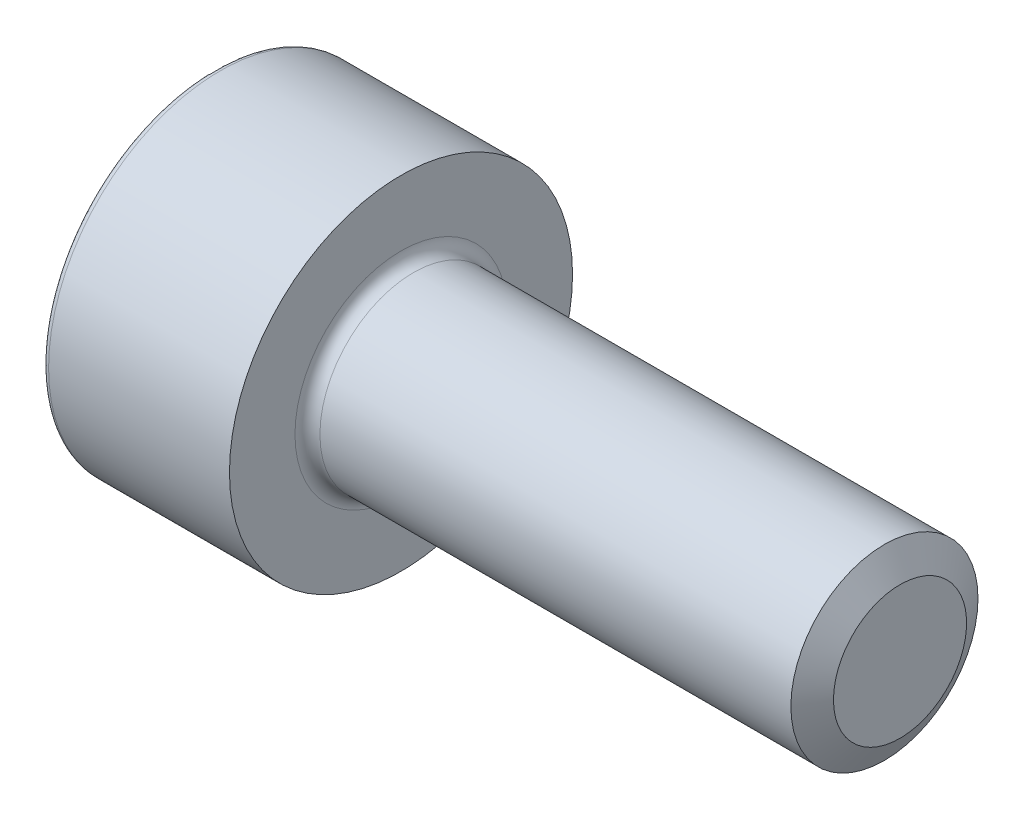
ISO-10303-21;
HEADER;
FILE_DESCRIPTION(('STEP AP214'),'2;1');
FILE_NAME('part.step','',(''),(''),'','','');
FILE_SCHEMA(('AUTOMOTIVE_DESIGN { 1 0 10303 214 1 1 1 1 }'));
ENDSEC;
DATA;
#1=APPLICATION_CONTEXT('core data for automotive mechanical design processes');
#2=APPLICATION_PROTOCOL_DEFINITION('international standard','automotive_design',2000,#1);
#3=PRODUCT_CONTEXT('',#1,'mechanical');
#4=PRODUCT('Part','Part','',(#3));
#5=PRODUCT_RELATED_PRODUCT_CATEGORY('part','',(#4));
#6=PRODUCT_DEFINITION_FORMATION('','',#4);
#7=PRODUCT_DEFINITION_CONTEXT('part definition',#1,'design');
#8=PRODUCT_DEFINITION('design','',#6,#7);
#9=PRODUCT_DEFINITION_SHAPE('','',#8);
#10=(LENGTH_UNIT() NAMED_UNIT(*) SI_UNIT(.MILLI.,.METRE.));
#11=(NAMED_UNIT(*) PLANE_ANGLE_UNIT() SI_UNIT($,.RADIAN.));
#12=(NAMED_UNIT(*) SI_UNIT($,.STERADIAN.) SOLID_ANGLE_UNIT());
#13=UNCERTAINTY_MEASURE_WITH_UNIT(LENGTH_MEASURE(1.E-05),#10,'distance_accuracy_value','');
#14=(GEOMETRIC_REPRESENTATION_CONTEXT(3) GLOBAL_UNCERTAINTY_ASSIGNED_CONTEXT((#13)) GLOBAL_UNIT_ASSIGNED_CONTEXT((#10,
#11,#12)) REPRESENTATION_CONTEXT('',''));
#15=CARTESIAN_POINT('',(0.,0.,0.));
#16=DIRECTION('',(0.,0.,1.));
#17=DIRECTION('',(1.,0.,0.));
#18=AXIS2_PLACEMENT_3D('',#15,#16,#17);
#19=CARTESIAN_POINT('',(0.,0.,0.));
#20=DIRECTION('',(-1.,0.,0.));
#21=DIRECTION('',(0.,0.,1.));
#22=AXIS2_PLACEMENT_3D('',#19,#20,#21);
#23=CYLINDRICAL_SURFACE('',#22,1.5);
#24=CARTESIAN_POINT('',(3.2,0.,0.));
#25=DIRECTION('',(-1.,0.,0.));
#26=DIRECTION('',(0.,0.,1.));
#27=AXIS2_PLACEMENT_3D('',#24,#25,#26);
#28=CIRCLE('',#27,1.5);
#29=CARTESIAN_POINT('',(3.2,0.,1.5));
#30=VERTEX_POINT('',#29);
#31=EDGE_CURVE('E141',#30,#30,#28,.T.);
#32=ORIENTED_EDGE('',*,*,#31,.F.);
#33=EDGE_LOOP('',(#32));
#34=FACE_BOUND('',#33,.T.);
#35=CARTESIAN_POINT('',(10.7500073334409,0.,0.));
#36=DIRECTION('',(-1.,0.,0.));
#37=DIRECTION('',(0.,0.,1.));
#38=AXIS2_PLACEMENT_3D('',#35,#36,#37);
#39=CIRCLE('',#38,1.5);
#40=CARTESIAN_POINT('',(10.7500073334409,0.,1.5));
#41=VERTEX_POINT('',#40);
#42=EDGE_CURVE('E278',#41,#41,#39,.T.);
#43=ORIENTED_EDGE('',*,*,#42,.T.);
#44=EDGE_LOOP('',(#43));
#45=FACE_BOUND('',#44,.T.);
#46=ADVANCED_FACE('F38',(#34,#45),#23,.T.);
#47=CARTESIAN_POINT('',(0.,0.,0.));
#48=DIRECTION('',(1.,0.,0.));
#49=DIRECTION('',(0.,0.,-1.));
#50=AXIS2_PLACEMENT_3D('',#47,#48,#49);
#51=PLANE('',#50);
#52=CARTESIAN_POINT('',(0.,0.,0.));
#53=DIRECTION('',(1.,0.,0.));
#54=DIRECTION('',(0.,0.,-1.));
#55=AXIS2_PLACEMENT_3D('',#52,#53,#54);
#56=CIRCLE('',#55,2.65);
#57=CARTESIAN_POINT('',(0.,0.,-2.65));
#58=VERTEX_POINT('',#57);
#59=EDGE_CURVE('E46',#58,#58,#56,.F.);
#60=ORIENTED_EDGE('',*,*,#59,.T.);
#61=EDGE_LOOP('',(#60));
#62=FACE_BOUND('',#61,.T.);
#63=DIRECTION('',(0.,0.866025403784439,-0.5));
#64=VECTOR('',#63,1.);
#65=CARTESIAN_POINT('',(0.,0.,1.435));
#66=LINE('',#65,#64);
#67=CARTESIAN_POINT('',(0.,0.,1.435));
#68=VERTEX_POINT('',#67);
#69=CARTESIAN_POINT('',(0.,1.24274645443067,0.717499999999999));
#70=VERTEX_POINT('',#69);
#71=EDGE_CURVE('E127',#68,#70,#66,.T.);
#72=ORIENTED_EDGE('',*,*,#71,.F.);
#73=DIRECTION('',(0.,0.866025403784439,0.5));
#74=VECTOR('',#73,1.);
#75=CARTESIAN_POINT('',(0.,-1.24274645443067,0.7175));
#76=LINE('',#75,#74);
#77=CARTESIAN_POINT('',(0.,-1.24274645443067,0.7175));
#78=VERTEX_POINT('',#77);
#79=EDGE_CURVE('E53',#78,#68,#76,.T.);
#80=ORIENTED_EDGE('',*,*,#79,.F.);
#81=DIRECTION('',(0.,0.,1.));
#82=VECTOR('',#81,1.);
#83=CARTESIAN_POINT('',(0.,-1.24274645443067,-0.7175));
#84=LINE('',#83,#82);
#85=CARTESIAN_POINT('',(0.,-1.24274645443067,-0.7175));
#86=VERTEX_POINT('',#85);
#87=EDGE_CURVE('E137',#86,#78,#84,.T.);
#88=ORIENTED_EDGE('',*,*,#87,.F.);
#89=DIRECTION('',(0.,-0.866025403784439,0.5));
#90=VECTOR('',#89,1.);
#91=CARTESIAN_POINT('',(0.,0.,-1.435));
#92=LINE('',#91,#90);
#93=CARTESIAN_POINT('',(0.,0.,-1.435));
#94=VERTEX_POINT('',#93);
#95=EDGE_CURVE('E135',#94,#86,#92,.T.);
#96=ORIENTED_EDGE('',*,*,#95,.F.);
#97=DIRECTION('',(0.,-0.866025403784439,-0.5));
#98=VECTOR('',#97,1.);
#99=CARTESIAN_POINT('',(0.,1.24274645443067,-0.7175));
#100=LINE('',#99,#98);
#101=CARTESIAN_POINT('',(0.,1.24274645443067,-0.7175));
#102=VERTEX_POINT('',#101);
#103=EDGE_CURVE('E101',#102,#94,#100,.T.);
#104=ORIENTED_EDGE('',*,*,#103,.F.);
#105=DIRECTION('',(0.,0.,-1.));
#106=VECTOR('',#105,1.);
#107=CARTESIAN_POINT('',(0.,1.24274645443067,0.717499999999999));
#108=LINE('',#107,#106);
#109=EDGE_CURVE('E131',#70,#102,#108,.T.);
#110=ORIENTED_EDGE('',*,*,#109,.F.);
#111=EDGE_LOOP('',(#72,#80,#88,#96,#104,#110));
#112=FACE_BOUND('',#111,.T.);
#113=ADVANCED_FACE('F158',(#62,#112),#51,.F.);
#114=CARTESIAN_POINT('',(0.,0.,0.));
#115=DIRECTION('',(-1.,0.,0.));
#116=DIRECTION('',(0.,0.,1.));
#117=AXIS2_PLACEMENT_3D('',#114,#115,#116);
#118=CYLINDRICAL_SURFACE('',#117,2.75);
#119=CARTESIAN_POINT('',(0.1,0.,0.));
#120=DIRECTION('',(1.,0.,0.));
#121=DIRECTION('',(0.,0.,-1.));
#122=AXIS2_PLACEMENT_3D('',#119,#120,#121);
#123=CIRCLE('',#122,2.75);
#124=CARTESIAN_POINT('',(0.1,0.,-2.75));
#125=VERTEX_POINT('',#124);
#126=EDGE_CURVE('E11',#125,#125,#123,.T.);
#127=ORIENTED_EDGE('',*,*,#126,.T.);
#128=EDGE_LOOP('',(#127));
#129=FACE_BOUND('',#128,.T.);
#130=CARTESIAN_POINT('',(3.,0.,0.));
#131=DIRECTION('',(-1.,0.,0.));
#132=DIRECTION('',(0.,0.,1.));
#133=AXIS2_PLACEMENT_3D('',#130,#131,#132);
#134=CIRCLE('',#133,2.75);
#135=CARTESIAN_POINT('',(3.,0.,2.75));
#136=VERTEX_POINT('',#135);
#137=EDGE_CURVE('E152',#136,#136,#134,.T.);
#138=ORIENTED_EDGE('',*,*,#137,.T.);
#139=EDGE_LOOP('',(#138));
#140=FACE_BOUND('',#139,.T.);
#141=ADVANCED_FACE('F177',(#129,#140),#118,.T.);
#142=CARTESIAN_POINT('',(3.,2.75,0.));
#143=DIRECTION('',(-1.,0.,0.));
#144=DIRECTION('',(0.,0.,1.));
#145=AXIS2_PLACEMENT_3D('',#142,#143,#144);
#146=PLANE('',#145);
#147=ORIENTED_EDGE('',*,*,#137,.F.);
#148=EDGE_LOOP('',(#147));
#149=FACE_BOUND('',#148,.T.);
#150=CARTESIAN_POINT('',(3.,0.,0.));
#151=DIRECTION('',(-1.,0.,0.));
#152=DIRECTION('',(0.,0.,1.));
#153=AXIS2_PLACEMENT_3D('',#150,#151,#152);
#154=CIRCLE('',#153,1.7);
#155=CARTESIAN_POINT('',(3.,0.,1.7));
#156=VERTEX_POINT('',#155);
#157=EDGE_CURVE('E149',#156,#156,#154,.T.);
#158=ORIENTED_EDGE('',*,*,#157,.T.);
#159=EDGE_LOOP('',(#158));
#160=FACE_BOUND('',#159,.T.);
#161=ADVANCED_FACE('F186',(#149,#160),#146,.F.);
#162=CARTESIAN_POINT('',(3.2,0.,0.));
#163=DIRECTION('',(-1.,0.,0.));
#164=DIRECTION('',(0.,0.,1.));
#165=AXIS2_PLACEMENT_3D('',#162,#163,#164);
#166=TOROIDAL_SURFACE('',#165,1.7,0.2);
#167=ORIENTED_EDGE('',*,*,#157,.F.);
#168=EDGE_LOOP('',(#167));
#169=FACE_BOUND('',#168,.T.);
#170=ORIENTED_EDGE('',*,*,#31,.T.);
#171=EDGE_LOOP('',(#170));
#172=FACE_BOUND('',#171,.T.);
#173=ADVANCED_FACE('F182',(#169,#172),#166,.F.);
#174=CARTESIAN_POINT('',(1.3,-1.24274645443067,0.7175));
#175=DIRECTION('',(0.,-0.5,0.866025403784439));
#176=DIRECTION('',(0.,-0.866025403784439,-0.5));
#177=AXIS2_PLACEMENT_3D('',#174,#175,#176);
#178=PLANE('',#177);
#179=ORIENTED_EDGE('',*,*,#79,.T.);
#180=DIRECTION('',(-1.,0.,0.));
#181=VECTOR('',#180,1.);
#182=CARTESIAN_POINT('',(1.3,0.,1.435));
#183=LINE('',#182,#181);
#184=CARTESIAN_POINT('',(1.3,0.,1.435));
#185=VERTEX_POINT('',#184);
#186=EDGE_CURVE('E83',#185,#68,#183,.T.);
#187=ORIENTED_EDGE('',*,*,#186,.F.);
#188=DIRECTION('',(0.,0.866025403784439,0.5));
#189=VECTOR('',#188,1.);
#190=CARTESIAN_POINT('',(1.3,-1.24274645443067,0.7175));
#191=LINE('',#190,#189);
#192=CARTESIAN_POINT('',(1.3,-1.24274645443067,0.7175));
#193=VERTEX_POINT('',#192);
#194=EDGE_CURVE('E139',#193,#185,#191,.T.);
#195=ORIENTED_EDGE('',*,*,#194,.F.);
#196=DIRECTION('',(-1.,0.,0.));
#197=VECTOR('',#196,1.);
#198=CARTESIAN_POINT('',(1.3,-1.24274645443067,0.7175));
#199=LINE('',#198,#197);
#200=EDGE_CURVE('E61',#193,#78,#199,.T.);
#201=ORIENTED_EDGE('',*,*,#200,.T.);
#202=EDGE_LOOP('',(#179,#187,#195,#201));
#203=FACE_BOUND('',#202,.T.);
#204=ADVANCED_FACE('F185',(#203),#178,.F.);
#205=CARTESIAN_POINT('',(1.3,-1.24274645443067,-0.7175));
#206=DIRECTION('',(0.,-1.,0.));
#207=DIRECTION('',(0.,0.,-1.));
#208=AXIS2_PLACEMENT_3D('',#205,#206,#207);
#209=PLANE('',#208);
#210=ORIENTED_EDGE('',*,*,#87,.T.);
#211=ORIENTED_EDGE('',*,*,#200,.F.);
#212=DIRECTION('',(0.,0.,1.));
#213=VECTOR('',#212,1.);
#214=CARTESIAN_POINT('',(1.3,-1.24274645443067,-0.7175));
#215=LINE('',#214,#213);
#216=CARTESIAN_POINT('',(1.3,-1.24274645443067,-0.7175));
#217=VERTEX_POINT('',#216);
#218=EDGE_CURVE('E113',#217,#193,#215,.T.);
#219=ORIENTED_EDGE('',*,*,#218,.F.);
#220=DIRECTION('',(-1.,0.,0.));
#221=VECTOR('',#220,1.);
#222=CARTESIAN_POINT('',(1.3,-1.24274645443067,-0.7175));
#223=LINE('',#222,#221);
#224=EDGE_CURVE('E105',#217,#86,#223,.T.);
#225=ORIENTED_EDGE('',*,*,#224,.T.);
#226=EDGE_LOOP('',(#210,#211,#219,#225));
#227=FACE_BOUND('',#226,.T.);
#228=ADVANCED_FACE('F216',(#227),#209,.F.);
#229=CARTESIAN_POINT('',(1.3,0.,-1.435));
#230=DIRECTION('',(0.,-0.5,-0.866025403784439));
#231=DIRECTION('',(0.,0.866025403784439,-0.5));
#232=AXIS2_PLACEMENT_3D('',#229,#230,#231);
#233=PLANE('',#232);
#234=ORIENTED_EDGE('',*,*,#95,.T.);
#235=ORIENTED_EDGE('',*,*,#224,.F.);
#236=DIRECTION('',(0.,-0.866025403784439,0.5));
#237=VECTOR('',#236,1.);
#238=CARTESIAN_POINT('',(1.3,0.,-1.435));
#239=LINE('',#238,#237);
#240=CARTESIAN_POINT('',(1.3,0.,-1.435));
#241=VERTEX_POINT('',#240);
#242=EDGE_CURVE('E109',#241,#217,#239,.T.);
#243=ORIENTED_EDGE('',*,*,#242,.F.);
#244=DIRECTION('',(-1.,0.,0.));
#245=VECTOR('',#244,1.);
#246=CARTESIAN_POINT('',(1.3,0.,-1.435));
#247=LINE('',#246,#245);
#248=EDGE_CURVE('E94',#241,#94,#247,.T.);
#249=ORIENTED_EDGE('',*,*,#248,.T.);
#250=EDGE_LOOP('',(#234,#235,#243,#249));
#251=FACE_BOUND('',#250,.T.);
#252=ADVANCED_FACE('F110',(#251),#233,.F.);
#253=CARTESIAN_POINT('',(1.3,1.24274645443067,-0.7175));
#254=DIRECTION('',(0.,0.5,-0.866025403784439));
#255=DIRECTION('',(0.,0.866025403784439,0.5));
#256=AXIS2_PLACEMENT_3D('',#253,#254,#255);
#257=PLANE('',#256);
#258=ORIENTED_EDGE('',*,*,#103,.T.);
#259=ORIENTED_EDGE('',*,*,#248,.F.);
#260=DIRECTION('',(0.,-0.866025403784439,-0.5));
#261=VECTOR('',#260,1.);
#262=CARTESIAN_POINT('',(1.3,1.24274645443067,-0.7175));
#263=LINE('',#262,#261);
#264=CARTESIAN_POINT('',(1.3,1.24274645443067,-0.7175));
#265=VERTEX_POINT('',#264);
#266=EDGE_CURVE('E98',#265,#241,#263,.T.);
#267=ORIENTED_EDGE('',*,*,#266,.F.);
#268=DIRECTION('',(-1.,0.,0.));
#269=VECTOR('',#268,1.);
#270=CARTESIAN_POINT('',(1.3,1.24274645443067,-0.7175));
#271=LINE('',#270,#269);
#272=EDGE_CURVE('E106',#265,#102,#271,.T.);
#273=ORIENTED_EDGE('',*,*,#272,.T.);
#274=EDGE_LOOP('',(#258,#259,#267,#273));
#275=FACE_BOUND('',#274,.T.);
#276=ADVANCED_FACE('F96',(#275),#257,.F.);
#277=CARTESIAN_POINT('',(1.3,1.24274645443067,0.717499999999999));
#278=DIRECTION('',(0.,1.,0.));
#279=DIRECTION('',(0.,0.,1.));
#280=AXIS2_PLACEMENT_3D('',#277,#278,#279);
#281=PLANE('',#280);
#282=ORIENTED_EDGE('',*,*,#109,.T.);
#283=ORIENTED_EDGE('',*,*,#272,.F.);
#284=DIRECTION('',(0.,0.,-1.));
#285=VECTOR('',#284,1.);
#286=CARTESIAN_POINT('',(1.3,1.24274645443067,0.717499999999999));
#287=LINE('',#286,#285);
#288=CARTESIAN_POINT('',(1.3,1.24274645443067,0.717499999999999));
#289=VERTEX_POINT('',#288);
#290=EDGE_CURVE('E119',#289,#265,#287,.T.);
#291=ORIENTED_EDGE('',*,*,#290,.F.);
#292=DIRECTION('',(-1.,0.,0.));
#293=VECTOR('',#292,1.);
#294=CARTESIAN_POINT('',(1.3,1.24274645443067,0.717499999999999));
#295=LINE('',#294,#293);
#296=EDGE_CURVE('E144',#289,#70,#295,.T.);
#297=ORIENTED_EDGE('',*,*,#296,.T.);
#298=EDGE_LOOP('',(#282,#283,#291,#297));
#299=FACE_BOUND('',#298,.T.);
#300=ADVANCED_FACE('F234',(#299),#281,.F.);
#301=CARTESIAN_POINT('',(1.3,0.,1.435));
#302=DIRECTION('',(0.,0.5,0.866025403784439));
#303=DIRECTION('',(0.,-0.866025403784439,0.5));
#304=AXIS2_PLACEMENT_3D('',#301,#302,#303);
#305=PLANE('',#304);
#306=ORIENTED_EDGE('',*,*,#71,.T.);
#307=ORIENTED_EDGE('',*,*,#296,.F.);
#308=DIRECTION('',(0.,0.866025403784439,-0.5));
#309=VECTOR('',#308,1.);
#310=CARTESIAN_POINT('',(1.3,0.,1.435));
#311=LINE('',#310,#309);
#312=EDGE_CURVE('E121',#185,#289,#311,.T.);
#313=ORIENTED_EDGE('',*,*,#312,.F.);
#314=ORIENTED_EDGE('',*,*,#186,.T.);
#315=EDGE_LOOP('',(#306,#307,#313,#314));
#316=FACE_BOUND('',#315,.T.);
#317=ADVANCED_FACE('F241',(#316),#305,.F.);
#318=CARTESIAN_POINT('',(1.3,-1.24274645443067,0.7175));
#319=DIRECTION('',(1.,0.,0.));
#320=DIRECTION('',(0.,0.,-1.));
#321=AXIS2_PLACEMENT_3D('',#318,#319,#320);
#322=PLANE('',#321);
#323=ORIENTED_EDGE('',*,*,#194,.T.);
#324=ORIENTED_EDGE('',*,*,#312,.T.);
#325=ORIENTED_EDGE('',*,*,#290,.T.);
#326=ORIENTED_EDGE('',*,*,#266,.T.);
#327=ORIENTED_EDGE('',*,*,#242,.T.);
#328=ORIENTED_EDGE('',*,*,#218,.T.);
#329=EDGE_LOOP('',(#323,#324,#325,#326,#327,#328));
#330=FACE_BOUND('',#329,.T.);
#331=ADVANCED_FACE('F116',(#330),#322,.F.);
#332=CARTESIAN_POINT('',(10.7500073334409,0.,0.));
#333=DIRECTION('',(-1.,0.,0.));
#334=DIRECTION('',(0.,0.,1.));
#335=AXIS2_PLACEMENT_3D('',#332,#333,#334);
#336=CONICAL_SURFACE('',#335,1.5,1.04719755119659);
#337=CARTESIAN_POINT('',(11.,0.,0.));
#338=DIRECTION('',(-1.,0.,0.));
#339=DIRECTION('',(0.,0.,1.));
#340=AXIS2_PLACEMENT_3D('',#337,#338,#339);
#341=CIRCLE('',#340,1.067);
#342=CARTESIAN_POINT('',(11.,0.,1.067));
#343=VERTEX_POINT('',#342);
#344=EDGE_CURVE('E128',#343,#343,#341,.T.);
#345=ORIENTED_EDGE('',*,*,#344,.T.);
#346=EDGE_LOOP('',(#345));
#347=FACE_BOUND('',#346,.T.);
#348=ORIENTED_EDGE('',*,*,#42,.F.);
#349=EDGE_LOOP('',(#348));
#350=FACE_BOUND('',#349,.T.);
#351=ADVANCED_FACE('F167',(#347,#350),#336,.T.);
#352=CARTESIAN_POINT('',(11.,1.5,0.));
#353=DIRECTION('',(-1.,0.,0.));
#354=DIRECTION('',(0.,0.,1.));
#355=AXIS2_PLACEMENT_3D('',#352,#353,#354);
#356=PLANE('',#355);
#357=ORIENTED_EDGE('',*,*,#344,.F.);
#358=EDGE_LOOP('',(#357));
#359=FACE_BOUND('',#358,.T.);
#360=ADVANCED_FACE('F162',(#359),#356,.F.);
#361=CARTESIAN_POINT('',(0.1,0.,0.));
#362=DIRECTION('',(1.,0.,0.));
#363=DIRECTION('',(0.,0.,-1.));
#364=AXIS2_PLACEMENT_3D('',#361,#362,#363);
#365=TOROIDAL_SURFACE('',#364,2.65,0.1);
#366=ORIENTED_EDGE('',*,*,#126,.F.);
#367=EDGE_LOOP('',(#366));
#368=FACE_BOUND('',#367,.T.);
#369=ORIENTED_EDGE('',*,*,#59,.F.);
#370=EDGE_LOOP('',(#369));
#371=FACE_BOUND('',#370,.T.);
#372=ADVANCED_FACE('F40',(#368,#371),#365,.T.);
#373=CLOSED_SHELL('',(#46,#113,#141,#161,#173,#204,#228,#252,#276,#300,#317,#331,#351,#360,#372));
#374=MANIFOLD_SOLID_BREP('B2',#373);
#375=ADVANCED_BREP_SHAPE_REPRESENTATION('',(#18,#374),#14);
#376=SHAPE_DEFINITION_REPRESENTATION(#9,#375);
ENDSEC;
END-ISO-10303-21;
